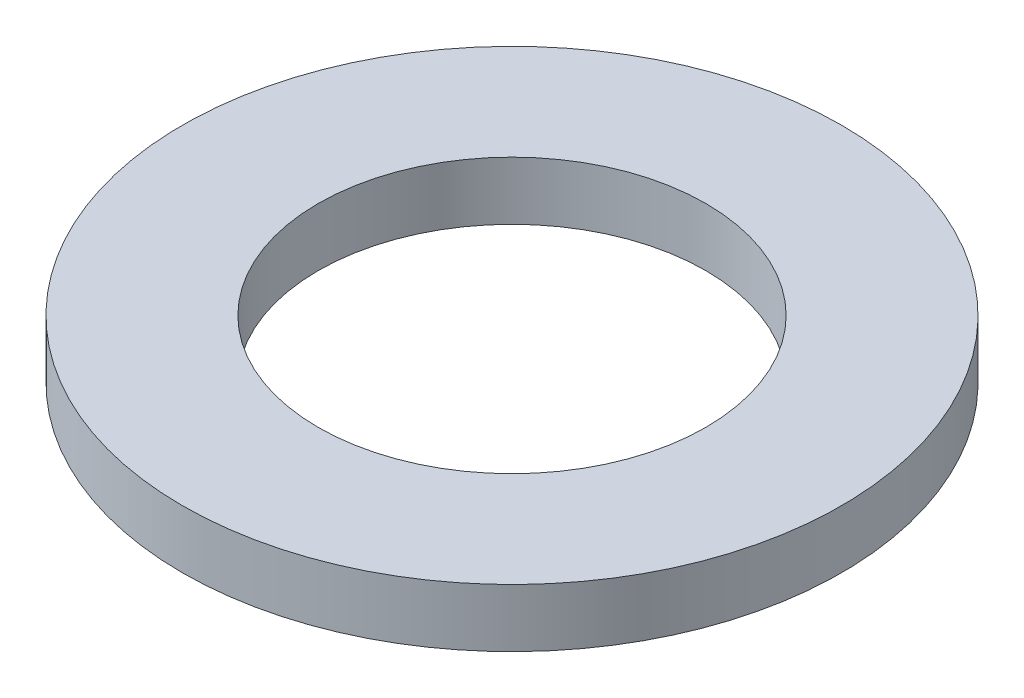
ISO-10303-21;
HEADER;
FILE_DESCRIPTION(('STEP AP214'),'2;1');
FILE_NAME('part.step','',(''),(''),'','','');
FILE_SCHEMA(('AUTOMOTIVE_DESIGN { 1 0 10303 214 1 1 1 1 }'));
ENDSEC;
DATA;
#1=APPLICATION_CONTEXT('core data for automotive mechanical design processes');
#2=APPLICATION_PROTOCOL_DEFINITION('international standard','automotive_design',2000,#1);
#3=PRODUCT_CONTEXT('',#1,'mechanical');
#4=PRODUCT('Part','Part','',(#3));
#5=PRODUCT_RELATED_PRODUCT_CATEGORY('part','',(#4));
#6=PRODUCT_DEFINITION_FORMATION('','',#4);
#7=PRODUCT_DEFINITION_CONTEXT('part definition',#1,'design');
#8=PRODUCT_DEFINITION('design','',#6,#7);
#9=PRODUCT_DEFINITION_SHAPE('','',#8);
#10=(LENGTH_UNIT() NAMED_UNIT(*) SI_UNIT(.MILLI.,.METRE.));
#11=(NAMED_UNIT(*) PLANE_ANGLE_UNIT() SI_UNIT($,.RADIAN.));
#12=(NAMED_UNIT(*) SI_UNIT($,.STERADIAN.) SOLID_ANGLE_UNIT());
#13=UNCERTAINTY_MEASURE_WITH_UNIT(LENGTH_MEASURE(1.E-05),#10,'distance_accuracy_value','');
#14=(GEOMETRIC_REPRESENTATION_CONTEXT(3) GLOBAL_UNCERTAINTY_ASSIGNED_CONTEXT((#13)) GLOBAL_UNIT_ASSIGNED_CONTEXT((#10,
#11,#12)) REPRESENTATION_CONTEXT('',''));
#15=CARTESIAN_POINT('',(0.,0.,0.));
#16=DIRECTION('',(0.,0.,1.));
#17=DIRECTION('',(1.,0.,0.));
#18=AXIS2_PLACEMENT_3D('',#15,#16,#17);
#19=CARTESIAN_POINT('',(0.,7.5,0.));
#20=DIRECTION('',(0.,1.,0.));
#21=DIRECTION('',(0.,0.,1.));
#22=AXIS2_PLACEMENT_3D('',#19,#20,#21);
#23=PLANE('',#22);
#24=CARTESIAN_POINT('',(0.,7.5,0.));
#25=DIRECTION('',(0.,1.,0.));
#26=DIRECTION('',(0.,0.,1.));
#27=AXIS2_PLACEMENT_3D('',#24,#25,#26);
#28=CIRCLE('',#27,42.5);
#29=CARTESIAN_POINT('',(0.,7.5,42.5));
#30=VERTEX_POINT('',#29);
#31=EDGE_CURVE('E10',#30,#30,#28,.T.);
#32=ORIENTED_EDGE('',*,*,#31,.T.);
#33=EDGE_LOOP('',(#32));
#34=FACE_BOUND('',#33,.T.);
#35=CARTESIAN_POINT('',(0.,7.5,0.));
#36=DIRECTION('',(0.,1.,0.));
#37=DIRECTION('',(0.,0.,1.));
#38=AXIS2_PLACEMENT_3D('',#35,#36,#37);
#39=CIRCLE('',#38,25.);
#40=CARTESIAN_POINT('',(0.,7.5,25.));
#41=VERTEX_POINT('',#40);
#42=EDGE_CURVE('E41',#41,#41,#39,.T.);
#43=ORIENTED_EDGE('',*,*,#42,.F.);
#44=EDGE_LOOP('',(#43));
#45=FACE_BOUND('',#44,.T.);
#46=ADVANCED_FACE('F30',(#34,#45),#23,.T.);
#47=CARTESIAN_POINT('',(0.,0.,0.));
#48=DIRECTION('',(0.,1.,0.));
#49=DIRECTION('',(0.,0.,1.));
#50=AXIS2_PLACEMENT_3D('',#47,#48,#49);
#51=PLANE('',#50);
#52=CARTESIAN_POINT('',(0.,0.,0.));
#53=DIRECTION('',(0.,1.,0.));
#54=DIRECTION('',(0.,0.,1.));
#55=AXIS2_PLACEMENT_3D('',#52,#53,#54);
#56=CIRCLE('',#55,42.5);
#57=CARTESIAN_POINT('',(0.,0.,42.5));
#58=VERTEX_POINT('',#57);
#59=EDGE_CURVE('E34',#58,#58,#56,.T.);
#60=ORIENTED_EDGE('',*,*,#59,.F.);
#61=EDGE_LOOP('',(#60));
#62=FACE_BOUND('',#61,.T.);
#63=CARTESIAN_POINT('',(0.,0.,0.));
#64=DIRECTION('',(0.,1.,0.));
#65=DIRECTION('',(0.,0.,1.));
#66=AXIS2_PLACEMENT_3D('',#63,#64,#65);
#67=CIRCLE('',#66,25.);
#68=CARTESIAN_POINT('',(0.,0.,25.));
#69=VERTEX_POINT('',#68);
#70=EDGE_CURVE('E43',#69,#69,#67,.T.);
#71=ORIENTED_EDGE('',*,*,#70,.T.);
#72=EDGE_LOOP('',(#71));
#73=FACE_BOUND('',#72,.T.);
#74=ADVANCED_FACE('F53',(#62,#73),#51,.F.);
#75=CARTESIAN_POINT('',(0.,7.5,0.));
#76=DIRECTION('',(0.,-1.,0.));
#77=DIRECTION('',(0.,0.,-1.));
#78=AXIS2_PLACEMENT_3D('',#75,#76,#77);
#79=CYLINDRICAL_SURFACE('',#78,42.5);
#80=ORIENTED_EDGE('',*,*,#31,.F.);
#81=EDGE_LOOP('',(#80));
#82=FACE_BOUND('',#81,.T.);
#83=ORIENTED_EDGE('',*,*,#59,.T.);
#84=EDGE_LOOP('',(#83));
#85=FACE_BOUND('',#84,.T.);
#86=ADVANCED_FACE('F32',(#82,#85),#79,.T.);
#87=CARTESIAN_POINT('',(0.,7.5,0.));
#88=DIRECTION('',(0.,-1.,0.));
#89=DIRECTION('',(0.,0.,-1.));
#90=AXIS2_PLACEMENT_3D('',#87,#88,#89);
#91=CYLINDRICAL_SURFACE('',#90,25.);
#92=ORIENTED_EDGE('',*,*,#42,.T.);
#93=EDGE_LOOP('',(#92));
#94=FACE_BOUND('',#93,.T.);
#95=ORIENTED_EDGE('',*,*,#70,.F.);
#96=EDGE_LOOP('',(#95));
#97=FACE_BOUND('',#96,.T.);
#98=ADVANCED_FACE('F49',(#94,#97),#91,.F.);
#99=CLOSED_SHELL('',(#46,#74,#86,#98));
#100=MANIFOLD_SOLID_BREP('B2',#99);
#101=ADVANCED_BREP_SHAPE_REPRESENTATION('',(#18,#100),#14);
#102=SHAPE_DEFINITION_REPRESENTATION(#9,#101);
ENDSEC;
END-ISO-10303-21;
